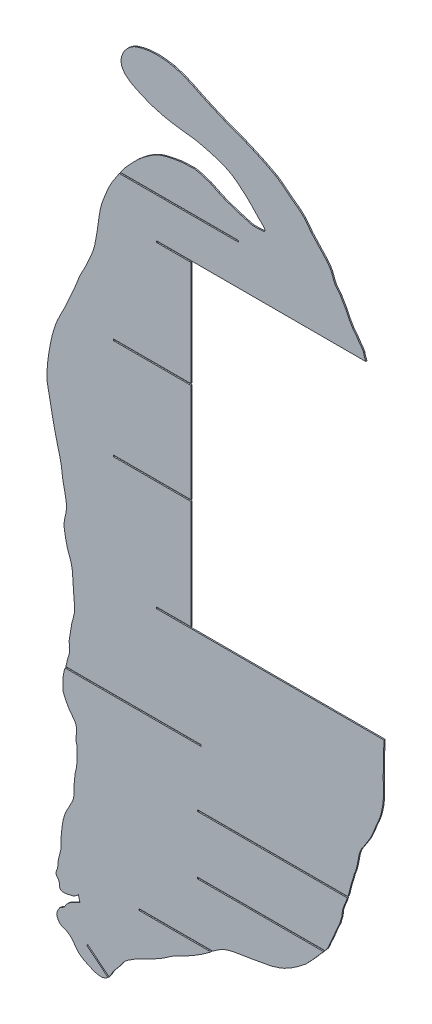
from build123d import *

# Parameters (mm, degrees)
EXTRUDE_1_DEPTH = 2


with BuildPart() as part:
    # Model → Extrude 1 (new body)
    with BuildSketch(Plane.XY):
        Polygon((-5720.7645, 1756.1752), (-5720.7423, 1756.163), (-5719.6567, 1755.4638), (-5719.6284, 1755.4456), (-5711.4029, 1749.8688), (-5701.3941, 1741.8561), (-5694.1958, 1736.0411), (-5685.0639, 1729.304), (-5681.0484, 1726.2993), (-5676.3296, 1721.9313), (-5674.2817, 1720.0016), (-5674.2283, 1719.9514), (-5673.5184, 1719.1248), (-5669.7691, 1714.4466), (-5662.7558, 1705.3026), (-5661.6993, 1703.8581), (-5661.302, 1703.3875), (-5638.8204, 1678.9669), (-5636.7454, 1676.7139), (-5636.463, 1676.3556), (-5636.4556, 1676.3463), (-5631.3712, 1669.6064), (-5631.02, 1668.9962), (-5631.0108, 1668.9803), (-5628.262, 1663.5153), (-5625.3571, 1655.6745), (-5625.1771, 1655.1682), (-5625.1724, 1655.155), (-5622.7109, 1649.7953), (-5621.6774, 1648.0975), (-5619.0281, 1644.9148), (-5618.9591, 1644.8318), (-5615.1097, 1639.7465), (-5613.8187, 1638.0131), (-5613.6729, 1637.7924), (-5613.6691, 1637.7867), (-5605.0998, 1623.1252), (-5599.9363, 1612.4005), (-5599.7194, 1611.9917), (-5599.7137, 1611.981), (-5593.8555, 1601.8342), (-5593.3587, 1600.9935), (-5593.3458, 1600.9716), (-5592.9846, 1600.469), (-5592.9752, 1600.4559), (-5587.3041, 1593.4584), (-5584.6405, 1589.4255), (-5583.3314, 1587.4953), (-5580.1594, 1583.1247), (-5577.6061, 1579.6612), (-5576.2619, 1577.1981), (-5575.3535, 1575.4191), (-5575.3298, 1575.3727), (-5574.8334, 1572.975), (-5574.1541, 1570.9494), (-5572.2273, 1565.5162), (-5571.4104, 1564.1595), (-5919.5427, 1564.1595), (-5919.5427, 1563.9095), (-5919.5427, 1561.9095), (-5919.5427, 1561.6595), (-5862.0015, 1561.6595), (-5862.0015, 1387.1595), (-5990.4768, 1387.1595), (-5990.4768, 1386.9095), (-5990.4768, 1384.9095), (-5990.4768, 1384.6595), (-5862.0015, 1384.6595), (-5862.0016, 1220.1596), (-5990.4768, 1220.1596), (-5990.4768, 1219.9096), (-5990.4768, 1217.9096), (-5990.4768, 1217.6596), (-5862.0016, 1217.6596), (-5862.0016, 1037.3393), (-5919.5428, 1037.3393), (-5919.5428, 1037.0893), (-5919.5428, 1035.0893), (-5919.5428, 1034.8393), (-5541.7403, 1034.8393), (-5541.561, 1030.4145), (-5541.5398, 1029.0932), (-5541.5392, 1029.0588), (-5541.9226, 1021.2011), (-5542.4495, 1012.3566), (-5542.4994, 1011.1336), (-5542.5006, 1011.1017), (-5542.5665, 1002.9496), (-5542.5913, 1002.4057), (-5542.5919, 1002.3915), (-5542.5315, 1000.1406), (-5542.5299, 1000.0819), (-5542.5778, 989.2162), (-5542.7091, 980.2941), (-5542.5697, 970.5373), (-5542.5763, 969.373), (-5542.5764, 969.3427), (-5542.255, 960.2873), (-5542.2417, 959.2189), (-5542.2413, 959.1911), (-5542.2948, 957.2109), (-5542.2962, 957.1593), (-5542.6725, 947.5964), (-5543.3958, 940.8068), (-5543.6448, 938.8814), (-5543.6513, 938.8312), (-5543.8084, 937.9206), (-5543.8124, 937.8969), (-5544.9636, 932.0661), (-5546.9867, 923.516), (-5547.3289, 922.244), (-5547.3378, 922.2109), (-5547.5449, 921.6065), (-5547.5503, 921.5907), (-5547.8286, 920.8103), (-5547.8358, 920.79), (-5551.1221, 912.351), (-5554.4054, 905.2912), (-5554.7184, 904.3753), (-5554.7265, 904.3515), (-5557.6825, 896.8102), (-5557.835, 896.3938), (-5557.8389, 896.383), (-5562.5253, 885.5439), (-5562.765, 885.0756), (-5562.7713, 885.0634), (-5564.5719, 881.4093), (-5564.7081, 881.2076), (-5564.7117, 881.2023), (-5565.2478, 880.4689), (-5565.8129, 879.4608), (-5565.8275, 879.4345), (-5569.2034, 874.1), (-5572.619, 868.7677), (-5576.0961, 863.3578), (-5578.5952, 859.5815), (-5578.6603, 859.4831), (-5579.4531, 858.2458), (-5579.4738, 858.2135), (-5581.3742, 853.3437), (-5582.2903, 850.8766), (-5582.3557, 850.7379), (-5582.3574, 850.7343), (-5583.4484, 845.5478), (-5583.6118, 844.9765), (-5583.6161, 844.9616), (-5584.6919, 838.3944), (-5584.7813, 838.1032), (-5584.7836, 838.0956), (-5584.919, 837.6078), (-5584.9226, 837.5951), (-5584.949, 837.5093), (-5584.9497, 837.507), (-5585.1881, 835.9518), (-5585.1943, 835.9113), (-5586.7528, 829.1264), (-5587.5255, 826.0293), (-5587.5456, 825.9486), (-5588.4413, 823.0538), (-5588.4647, 822.9784), (-5590.8223, 816.9853), (-5592.0294, 812.859), (-5592.2666, 811.5061), (-5592.2728, 811.4709), (-5593.1541, 808.9027), (-5594.577, 804.3442), (-5595.8833, 799.9225), (-5596.6396, 797.2211), (-5599.2746, 786.414), (-5600.2792, 782.6288), (-5600.3054, 782.5302), (-5600.3313, 782.4514), (-5601.2455, 779.6758), (-5850.9317, 779.6758), (-5850.9317, 779.4259), (-5850.9317, 777.4259), (-5850.9317, 777.1758), (-5602.1702, 777.1758), (-5604.2113, 771.6266), (-5605.1583, 769.0752), (-5605.183, 769.0087), (-5606.6002, 765.9443), (-5607.4046, 763.9447), (-5607.7544, 762.9038), (-5607.7635, 762.8766), (-5610.1027, 756.4938), (-5610.5859, 753.0234), (-5610.9729, 750.33), (-5611.0358, 749.0144), (-5611.0374, 748.9801), (-5611.445, 746.7902), (-5611.4667, 745.4723), (-5611.4672, 745.4379), (-5612.1517, 743.0602), (-5612.1695, 742.9982), (-5612.6953, 741.4294), (-5612.7091, 741.3886), (-5613.4852, 738.8095), (-5614.4804, 734.7704), (-5617.9318, 727.475), (-5618.0631, 727.1029), (-5618.0665, 727.0932), (-5618.2178, 726.7603), (-5618.2218, 726.7516), (-5618.3677, 726.5413), (-5618.3715, 726.5358), (-5619.883, 723.3044), (-5622.8162, 716.0453), (-5624.7991, 711.1867), (-5625.8775, 708.6988), (-5625.9056, 708.6339), (-5628.3768, 703.131), (-5630.4803, 698.7765), (-5630.6427, 698.3583), (-5630.647, 698.3473), (-5630.7943, 698.1294), (-5630.7981, 698.1237), (-5633.3043, 691.8984), (-5633.4089, 691.7251), (-5633.4117, 691.7206), (-5633.4667, 691.5334), (-5633.4681, 691.5285), (-5634.5653, 689.2409), (-5635.5597, 687.5232), (-5635.5856, 687.4784), (-5636.2843, 686.5462), (-5636.3025, 686.5219), (-5639.4276, 682.7487), (-5850.9318, 682.7487), (-5850.9318, 682.4987), (-5850.9318, 680.4987), (-5850.9318, 680.2487), (-5641.5986, 680.2487), (-5645.4326, 676.0226), (-5650.2833, 670.6169), (-5652.9255, 667.4826), (-5653.3837, 666.9101), (-5653.3956, 666.8952), (-5653.4103, 666.8893), (-5658.4632, 661.1242), (-5658.8568, 660.7619), (-5658.9264, 660.6786), (-5658.9282, 660.6764), (-5662.8602, 656.4069), (-5663.3469, 655.9148), (-5663.3596, 655.902), (-5669.2565, 649.686), (-5672.9324, 645.8893), (-5673.2878, 645.5675), (-5673.6187, 645.844), (-5673.6273, 645.8512), (-5681.884, 639.2367), (-5683.2779, 638.2514), (-5683.3142, 638.2257), (-5683.6707, 637.9219), (-5683.68, 637.914), (-5691.5084, 632.5395), (-5691.9498, 632.2178), (-5691.9613, 632.2094), (-5692.1858, 632.0243), (-5692.1917, 632.0194), (-5700.4853, 627.0304), (-5701.1116, 626.6805), (-5701.1279, 626.6714), (-5708.062, 623.1426), (-5708.6421, 622.8932), (-5708.6572, 622.8867), (-5713.4533, 620.781), (-5713.876, 620.6418), (-5713.887, 620.6382), (-5719.0112, 619.013), (-5719.1204, 618.9999), (-5719.1232, 618.9995), (-5728.9658, 615.9468), (-5729.1416, 615.9047), (-5729.1461, 615.9036), (-5729.6204, 615.8056), (-5729.6327, 615.803), (-5736.4069, 614.3601), (-5736.9218, 614.5288), (-5736.9352, 614.5332), (-5742.6622, 613.5036), (-5742.8114, 613.4768), (-5758.1019, 610.6018), (-5758.9182, 610.4788), (-5758.9395, 610.4756), (-5759.166, 610.4182), (-5759.1719, 610.4168), (-5769.822, 608.7009), (-5770.6323, 608.5913), (-5770.6535, 608.5884), (-5790.8765, 605.249), (-5792.6693, 604.9299), (-5792.716, 604.9216), (-5801.4142, 602.5936), (-5801.6408, 602.533), (-5802.0875, 602.4373), (-5802.0991, 602.4348), (-5802.2576, 602.3903), (-5802.2617, 602.3892), (-5806.2536, 600.8839), (-5806.3576, 600.8447), (-5806.4725, 600.8019), (-5806.4755, 600.8008), (-5806.5929, 600.747), (-5806.596, 600.7456), (-5812.636, 597.7551), (-5812.7933, 597.6773), (-5812.9477, 597.5992), (-5812.9517, 597.5972), (-5813.1488, 597.4587), (-5813.1539, 597.4551), (-5813.2656, 597.3735), (-5813.2685, 597.3714), (-5820.4168, 592.7578), (-5825.6087, 588.7793), (-5948.6192, 588.7793), (-5948.6192, 588.5293), (-5948.6192, 586.5293), (-5948.6192, 586.2793), (-5828.8713, 586.2793), (-5832.3909, 583.5823), (-5833.4257, 582.8095), (-5833.4526, 582.7893), (-5844.6318, 574.8821), (-5845.0852, 574.5791), (-5845.692, 574.172), (-5845.7078, 574.1614), (-5856.1757, 567.7527), (-5856.8114, 567.377), (-5856.828, 567.3672), (-5857.7402, 566.8385), (-5857.7639, 566.8247), (-5868.8213, 560.5159), (-5883.6381, 553.1712), (-5885.0059, 552.5109), (-5885.0415, 552.4937), (-5885.7383, 552.0853), (-5885.7565, 552.0747), (-5890.7038, 549.4117), (-5890.8327, 549.3423), (-5895.4379, 546.3638), (-5896.0512, 545.9893), (-5896.0671, 545.9795), (-5906.1433, 539.0095), (-5906.8104, 538.5615), (-5906.8278, 538.5498), (-5907.5204, 538.1099), (-5915.1137, 533.5452), (-5916.9269, 532.5501), (-5916.9741, 532.5242), (-5931.263, 524.7666), (-5932.7254, 524.0669), (-5932.7634, 524.0486), (-5948.4082, 516.3801), (-5949.0545, 516.0315), (-5956.3504, 511.9844), (-5957.3703, 511.3503), (-5957.3969, 511.3338), (-5967.6246, 504.7581), (-5971.4758, 501.4592), (-5971.8981, 501.1369), (-5971.9091, 501.1284), (-5972.1318, 500.8996), (-5972.1376, 500.8936), (-5975.1629, 497.6174), (-5975.5079, 497.094), (-5975.5169, 497.0803), (-5980.5388, 489.9724), (-5980.9363, 489.4558), (-5980.9467, 489.4424), (-5988.408, 480.5349), (-5991.2496, 476.7744), (-5991.5918, 476.3649), (-5991.6007, 476.3542), (-5991.7805, 476.0725), (-5991.7852, 476.0651), (-5991.9603, 475.7131), (-5991.9649, 475.7038), (-5992.3936, 474.8481), (-5995.7736, 468.9475), (-5998.0645, 465.7524), (-6033.4784, 494.4301), (-6033.643, 494.2268), (-6033.6459, 494.2291), (-6034.8726, 492.7146), (-6034.8696, 492.7121), (-6035.008, 492.5412), (-5999.7714, 464.0072), (-6003.1079, 461.6398), (-6003.2801, 461.5324), (-6003.2846, 461.5295), (-6003.3905, 461.4885), (-6003.3932, 461.4873), (-6004.248, 461.1423), (-6004.2703, 461.1333), (-6008.0708, 459.6464), (-6008.1698, 459.6076), (-6012.065, 459.3505), (-6012.1665, 459.3437), (-6013.0173, 459.3219), (-6013.0394, 459.3212), (-6016.5416, 459.7731), (-6016.7288, 459.8103), (-6016.7337, 459.8112), (-6020.7661, 460.7807), (-6020.8711, 460.8059), (-6021.0174, 460.8571), (-6021.0213, 460.8584), (-6026.1447, 462.7315), (-6026.2782, 462.7802), (-6027.3551, 463.2395), (-6033.0088, 465.769), (-6038.6387, 468.4306), (-6039.4776, 468.9194), (-6039.4994, 468.9321), (-6040.1791, 469.3569), (-6040.1968, 469.3679), (-6045.2121, 472.3803), (-6045.3428, 472.4587), (-6048.9075, 475.4785), (-6052.3038, 479.3784), (-6052.84, 479.9528), (-6053.0339, 480.1816), (-6053.039, 480.1875), (-6056.8781, 486.0669), (-6057.1957, 486.4362), (-6057.204, 486.4458), (-6059.5072, 489.413), (-6059.5671, 489.4903), (-6063.6073, 493.1882), (-6063.885, 493.4295), (-6063.8922, 493.4358), (-6068.7172, 496.4773), (-6068.9197, 496.5986), (-6068.9249, 496.6018), (-6069.0206, 496.643), (-6069.0231, 496.6441), (-6077.4746, 500.1795), (-6077.6434, 500.2564), (-6080.928, 502.8386), (-6080.9777, 502.8881), (-6080.979, 502.8894), (-6081.007, 502.9244), (-6081.0077, 502.9253), (-6084.408, 509.1157), (-6084.4564, 509.2652), (-6084.4577, 509.2691), (-6085.0195, 512.2205), (-6085.0192, 512.3169), (-6085.0192, 512.3194), (-6085.0056, 512.5235), (-6085.0053, 512.5288), (-6084.2853, 516.0403), (-6083.2029, 519.2211), (-6083.1747, 519.304), (-6083.0755, 519.5486), (-6083.0729, 519.5549), (-6082.2755, 520.8148), (-6082.2548, 520.8477), (-6080.3015, 523.9099), (-6080.1409, 524.1023), (-6079.3021, 524.848), (-6079.2803, 524.8674), (-6078.761, 525.2755), (-6078.7474, 525.2861), (-6075.918, 526.8364), (-6075.8607, 526.8845), (-6073.9029, 528.0642), (-6073.8519, 528.095), (-6071.5021, 530.302), (-6071.4469, 530.3574), (-6071.4454, 530.3589), (-6071.2239, 530.7132), (-6071.2182, 530.7224), (-6069.3932, 533.9463), (-6066.6342, 537.0039), (-6066.4089, 537.2794), (-6066.4031, 537.2866), (-6066.3419, 537.3485), (-6066.3403, 537.3501), (-6063.2214, 539.7859), (-6063.1515, 539.8397), (-6063.1497, 539.8411), (-6060.4361, 541.6019), (-6060.3654, 541.6477), (-6060.2326, 541.7291), (-6060.2291, 541.7312), (-6060.1145, 541.7898), (-6060.1115, 541.7913), (-6055.501, 544.0634), (-6055.3809, 544.1226), (-6055.2175, 544.193), (-6055.2133, 544.1948), (-6046.812, 548.0784), (-6046.5959, 548.1671), (-6046.5902, 548.1695), (-6046.4109, 548.233), (-6046.4063, 548.2346), (-6049.1226, 558.6489), (-6050.7388, 556.8391), (-6050.8156, 556.7154), (-6050.8176, 556.7122), (-6050.9495, 556.6174), (-6050.9529, 556.615), (-6055.692, 553.2566), (-6055.6948, 553.255), (-6055.6976, 553.2537), (-6055.7003, 553.252), (-6055.7032, 553.2506), (-6055.7059, 553.2484), (-6055.7088, 553.2469), (-6055.7116, 553.2457), (-6058.1073, 552.2465), (-6058.1697, 552.2205), (-6058.2439, 552.1924), (-6058.2459, 552.1917), (-6058.4607, 552.1279), (-6058.4663, 552.1262), (-6059.4382, 551.8976), (-6059.4635, 551.8916), (-6067.6043, 550.0833), (-6072.8237, 549.4534), (-6073.2406, 549.4213), (-6073.2515, 549.4204), (-6073.4925, 549.4268), (-6073.4988, 549.427), (-6075.704, 549.6643), (-6075.7615, 549.6704), (-6077.787, 550.3313), (-6078.2321, 550.5269), (-6078.2437, 550.532), (-6079.4532, 551.9439), (-6079.4848, 551.9807), (-6079.5522, 552.078), (-6079.554, 552.0806), (-6079.6691, 552.3499), (-6080.1204, 554.0562), (-6080.6005, 558.5742), (-6080.6742, 559.5191), (-6081.8167, 563.052), (-6081.9385, 563.4658), (-6081.9417, 563.4766), (-6082.406, 564.0519), (-6082.4181, 564.0669), (-6085.3895, 568.2136), (-6086.22, 570.0934), (-6086.2416, 570.1424), (-6086.304, 570.4141), (-6086.3057, 570.4212), (-6086.3072, 570.5413), (-6086.3073, 570.5445), (-6086.2213, 572.3235), (-6086.0617, 572.8491), (-6086.0575, 572.8628), (-6083.4589, 580.0269), (-6083.4269, 580.216), (-6083.426, 580.221), (-6082.8793, 588.4055), (-6082.8569, 588.8184), (-6082.7069, 589.6216), (-6081.2841, 596.6887), (-6078.6132, 607.2295), (-6078.2799, 608.5056), (-6077.653, 613.2378), (-6077.6264, 613.4534), (-6077.6257, 613.459), (-6078.2197, 621.0557), (-6078.2424, 621.4373), (-6078.2429, 621.4473), (-6077.9534, 626.1426), (-6077.9111, 626.5166), (-6077.91, 626.5264), (-6077.1909, 631.5439), (-6076.3452, 641.8529), (-6076.2992, 642.3286), (-6076.298, 642.341), (-6074.4562, 652.9037), (-6074.3689, 653.323), (-6074.3666, 653.3339), (-6074.311, 653.5392), (-6074.3095, 653.5446), (-6072.2733, 660.8131), (-6072.1757, 661.0858), (-6072.1732, 661.0929), (-6069.8623, 667.0331), (-6069.7931, 667.1735), (-6069.7913, 667.1772), (-6069.4073, 667.9236), (-6069.3973, 667.943), (-6059.434, 686.9513), (-6057.9368, 690.727), (-6057.8769, 690.8517), (-6057.8753, 690.8549), (-6057.8444, 691.0012), (-6057.8436, 691.005), (-6056.784, 695.3901), (-6056.3281, 702.7514), (-6056.3021, 702.9563), (-6056.3015, 702.9616), (-6056.3048, 703.0846), (-6056.3049, 703.0878), (-6056.3343, 703.2343), (-6056.5014, 705.9599), (-6056.1418, 713.2592), (-6056.1024, 713.831), (-6055.5219, 718.611), (-6055.5011, 718.7457), (-6055.5006, 718.7492), (-6055.48, 718.9381), (-6055.4794, 718.943), (-6055.4757, 719.0118), (-6055.4757, 719.0136), (-6055.2076, 723.2919), (-6054.4489, 729.5866), (-6054.4413, 729.6994), (-6054.4411, 729.7023), (-6054.4004, 729.9255), (-6054.3994, 729.9313), (-6052.2238, 740.3451), (-6051.768, 743.8149), (-6051.7628, 744.0466), (-6051.7626, 744.0527), (-6051.6499, 750.7292), (-6051.6395, 750.9269), (-6051.6392, 750.932), (-6051.3784, 757.8153), (-6051.3881, 758.0219), (-6051.6134, 763.3871), (-6051.6188, 763.589), (-6051.3325, 770.8131), (-6051.3408, 770.896), (-6051.341, 770.8981), (-6051.3942, 771.1698), (-6052.8486, 777.8656), (-6052.8539, 777.9789), (-6052.8541, 777.9819), (-6052.9916, 782.4408), (-6052.9677, 782.7226), (-6052.0018, 792.6332), (-6052.0062, 793.0568), (-6052.1773, 797.1286), (-6052.4064, 798.0453), (-6053.1232, 800.8664), (-6053.8753, 802.4623), (-6054.5561, 804.3813), (-6056.0642, 806.5041), (-6057.1241, 808.0181), (-6057.1517, 808.0575), (-6061.3537, 813.6928), (-6061.3737, 813.7187), (-6061.3837, 813.7332), (-6064.5982, 818.1261), (-6066.4793, 821.3554), (-6068.2822, 824.5954), (-6068.3745, 824.7843), (-6068.3769, 824.7892), (-6072.4855, 833.3632), (-6074.0581, 837.3744), (-6074.1089, 837.5252), (-6074.1102, 837.5292), (-6074.1564, 837.6806), (-6074.2269, 837.9216), (-6074.2287, 837.9279), (-6074.8837, 842.4086), (-6074.9146, 844.9621), (-6074.8923, 848.4582), (-6074.5061, 858.3456), (-6074.4659, 858.9491), (-6073.2242, 866.2829), (-6071.9416, 871.3627), (-6071.8885, 871.5364), (-6071.8872, 871.5409), (-6071.7281, 872.0756), (-6071.1208, 873.6595), (-5844.9587, 873.6595), (-5844.9587, 873.9096), (-5844.9586, 875.9096), (-5844.9587, 876.1595), (-6070.1623, 876.1595), (-6068.7243, 879.9096), (-6068.6674, 880.222), (-6068.666, 880.2301), (-6067.1885, 888.1906), (-6067.0662, 888.5823), (-6067.0631, 888.5924), (-6064.4558, 896.3527), (-6064.3637, 896.678), (-6064.3613, 896.6864), (-6063.6658, 900.7284), (-6064.2275, 906.6991), (-6064.2348, 906.9756), (-6064.2349, 906.9828), (-6064.0596, 911.0927), (-6064.0593, 911.3119), (-6064.0593, 911.3175), (-6064.0688, 911.4315), (-6064.069, 911.4345), (-6064.0881, 911.4902), (-6064.0886, 911.4916), (-6064.4406, 915.3236), (-6063.7697, 920.4037), (-6063.697, 920.6855), (-6063.6951, 920.6928), (-6063.6855, 920.8986), (-6063.6853, 920.904), (-6062.3162, 928.5595), (-6062.2879, 928.706), (-6062.2872, 928.7099), (-6062.2759, 928.8569), (-6062.2756, 928.8608), (-6062.2695, 929.0163), (-6062.2694, 929.0204), (-6061.6035, 934.0585), (-6060.554, 939.3937), (-6060.4962, 939.6242), (-6060.4947, 939.6303), (-6060.3997, 940.3603), (-6059.9077, 944.1974), (-6058.7263, 948.0905), (-6058.5776, 948.4848), (-6058.5737, 948.495), (-6058.5366, 948.693), (-6058.5356, 948.6982), (-6057.4581, 953.0746), (-6057.4185, 953.1822), (-6057.4174, 953.185), (-6055.9058, 959.5221), (-6055.8762, 959.7936), (-6055.8112, 964.2228), (-6055.7893, 964.3656), (-6055.7888, 964.3693), (-6055.762, 968.1039), (-6055.7366, 968.2807), (-6055.7645, 968.4944), (-6055.7652, 968.4999), (-6055.5516, 971.0815), (-6055.7237, 974.4381), (-6055.7207, 974.668), (-6055.7207, 974.674), (-6055.8813, 976.3315), (-6056.8496, 987.5922), (-6058.5361, 1012.6139), (-6058.7894, 1016.5307), (-6059.4272, 1021.9047), (-6060.3267, 1026.7641), (-6060.3748, 1027.1403), (-6060.4562, 1027.4408), (-6062.3291, 1034.0719), (-6062.6765, 1035.0065), (-6067.1308, 1047.3937), (-6067.3366, 1048.1313), (-6067.342, 1048.1506), (-6068.9282, 1054.5727), (-6070.5589, 1062.3791), (-6070.7465, 1063.381), (-6072.4086, 1072.9579), (-6072.4653, 1073.3772), (-6072.4667, 1073.3881), (-6072.486, 1073.5749), (-6072.4865, 1073.5798), (-6072.8375, 1080.0363), (-6072.8264, 1080.235), (-6072.8261, 1080.2402), (-6072.0959, 1086.5771), (-6072.0029, 1087.0463), (-6069.8565, 1096.778), (-6068.9462, 1103.1401), (-6068.9131, 1103.2942), (-6068.9122, 1103.2983), (-6068.8936, 1103.47), (-6068.8931, 1103.4745), (-6068.8977, 1103.6122), (-6068.8178, 1109.2011), (-6068.8203, 1109.2756), (-6068.8204, 1109.2775), (-6068.8694, 1109.5078), (-6068.8707, 1109.5138), (-6069.2344, 1113.0448), (-6071.5841, 1126.6391), (-6071.679, 1127.2116), (-6071.7677, 1127.6271), (-6073.7811, 1136.8354), (-6073.8302, 1137.0919), (-6073.8315, 1137.0985), (-6075.1843, 1144.5475), (-6075.2739, 1145.2463), (-6077.2106, 1160.5928), (-6077.2889, 1161.0749), (-6079.6213, 1172.6643), (-6079.755, 1173.2218), (-6084.7082, 1192.5008), (-6084.9621, 1193.5003), (-6087.9289, 1205.8529), (-6088.0361, 1206.3051), (-6088.2104, 1207.0732), (-6092.425, 1226.9196), (-6092.5419, 1227.5165), (-6092.7681, 1228.6589), (-6097.1193, 1251.2991), (-6100.3982, 1267.5198), (-6100.5553, 1268.3135), (-6100.573, 1268.4607), (-6100.5734, 1268.4645), (-6101.3593, 1275.8701), (-6101.3656, 1276.1135), (-6101.3658, 1276.1198), (-6101.1283, 1286.5056), (-6101.1068, 1286.8613), (-6101.1062, 1286.8705), (-6099.8982, 1300.1446), (-6099.8604, 1300.4721), (-6099.8594, 1300.4807), (-6099.8305, 1300.7135), (-6099.8298, 1300.7195), (-6098.2028, 1312.6402), (-6098.1186, 1313.1835), (-6098.1164, 1313.1977), (-6096.4264, 1322.914), (-6094.7071, 1332.0339), (-6094.5854, 1332.6161), (-6092.5064, 1341.3824), (-6092.4378, 1341.6553), (-6092.436, 1341.6624), (-6092.3112, 1342.1108), (-6090.1363, 1349.9367), (-6087.0919, 1359.2883), (-6086.9629, 1359.6658), (-6086.9595, 1359.6756), (-6086.8729, 1359.8908), (-6086.8707, 1359.8964), (-6083.4982, 1368.2613), (-6083.3907, 1368.4965), (-6083.3879, 1368.5026), (-6079.7331, 1376.1663), (-6079.5339, 1376.5573), (-6079.5288, 1376.5674), (-6071.2248, 1392.8723), (-6071.0938, 1393.1414), (-6071.0904, 1393.1484), (-6055.0881, 1428.8797), (-6054.8957, 1429.302), (-6054.8907, 1429.313), (-6048.9509, 1444.4758), (-6048.7142, 1445.0622), (-6048.7081, 1445.0775), (-6046.0364, 1451.2798), (-6045.9448, 1451.4821), (-6045.9425, 1451.4874), (-6045.8175, 1451.7554), (-6043.2495, 1456.7717), (-6038.6514, 1465.431), (-6038.3497, 1465.9803), (-6038.2292, 1466.2234), (-6038.226, 1466.2297), (-6035.4104, 1471.9074), (-6035.261, 1472.2509), (-6035.2572, 1472.2598), (-6026.5535, 1492.1559), (-6026.4836, 1492.3267), (-6026.4818, 1492.3311), (-6024.3083, 1497.8181), (-6024.2945, 1497.8575), (-6024.2941, 1497.8586), (-6022.6741, 1503.3915), (-6022.6163, 1503.6229), (-6022.6148, 1503.629), (-6021.2963, 1509.6111), (-6017.8223, 1529.1677), (-6017.6942, 1529.9157), (-6014.6945, 1551.1649), (-6014.5506, 1552.2379), (-6012.6898, 1562.5942), (-6012.5546, 1563.2314), (-6010.2412, 1571.8548), (-6007.7252, 1579.0054), (-6007.6126, 1579.3829), (-6007.6097, 1579.3928), (-6007.5013, 1579.6983), (-6007.4985, 1579.7062), (-6006.8992, 1581.1677), (-6006.8836, 1581.2057), (-6000.0545, 1597.8823), (-5999.3598, 1599.2885), (-5999.3417, 1599.3251), (-5995.8111, 1606.7101), (-5993.5845, 1610.5405), (-5991.9836, 1613.3013), (-5985.0183, 1623.9139), (-5983.3498, 1626.5015), (-5980.9363, 1630.0496), (-5783.4091, 1630.0496), (-5783.4091, 1630.2997), (-5783.4091, 1632.2996), (-5783.4091, 1632.5496), (-5979.2356, 1632.5496), (-5976.8497, 1636.0571), (-5976.442, 1636.6646), (-5976.4313, 1636.6805), (-5975.7322, 1637.5098), (-5971.7402, 1642.6873), (-5966.4016, 1648.7596), (-5965.3872, 1649.8343), (-5957.0622, 1658.6147), (-5956.0016, 1659.6525), (-5955.9739, 1659.6795), (-5950.1926, 1665.5372), (-5943.4578, 1671.1445), (-5939.585, 1674.3679), (-5934.3775, 1678.1569), (-5931.1159, 1680.5043), (-5926.8271, 1683.1942), (-5923.0882, 1685.5257), (-5919.5305, 1687.3697), (-5918.7635, 1687.7949), (-5918.7435, 1687.806), (-5913.1185, 1690.2706), (-5912.7012, 1690.4314), (-5912.6904, 1690.4356), (-5903.9146, 1693.0544), (-5903.256, 1693.2312), (-5903.2388, 1693.2358), (-5891.5202, 1695.8041), (-5890.5953, 1695.9966), (-5890.5712, 1696.0016), (-5889.7828, 1696.1419), (-5889.7623, 1696.1456), (-5880.8346, 1697.6605), (-5879.7448, 1697.7886), (-5879.7164, 1697.7919), (-5872.3587, 1698.4983), (-5872.1671, 1698.5167), (-5871.1394, 1698.5816), (-5862.9037, 1698.7338), (-5857.4505, 1699.1693), (-5856.7573, 1699.0994), (-5856.7393, 1699.0976), (-5849.9513, 1697.9102), (-5849.6025, 1697.801), (-5849.5934, 1697.7982), (-5840.4733, 1695.1245), (-5839.7886, 1694.8735), (-5839.7708, 1694.867), (-5839.1766, 1694.6812), (-5839.1611, 1694.6763), (-5830.2575, 1691.6962), (-5826.5779, 1689.9844), (-5826.482, 1689.9398), (-5825.7088, 1689.6283), (-5825.6887, 1689.6202), (-5822.5504, 1688.0765), (-5815.1532, 1684.5731), (-5812.3564, 1683.4144), (-5805.9614, 1680.3578), (-5805.9583, 1680.3566), (-5805.9552, 1680.3556), (-5805.9521, 1680.3541), (-5805.949, 1680.353), (-5805.9458, 1680.3514), (-5805.9427, 1680.3503), (-5805.9396, 1680.3494), (-5805.908, 1680.3372), (-5805.5894, 1680.2261), (-5805.5811, 1680.2232), (-5783.6768, 1672.6519), (-5781.8538, 1671.9996), (-5781.8063, 1671.9826), (-5779.9533, 1671.5187), (-5774.943, 1670.3895), (-5769.9326, 1668.7858), (-5766.955, 1667.827), (-5766.8774, 1667.8021), (-5766.0323, 1667.665), (-5763.3214, 1666.8438), (-5759.418, 1666.0313), (-5758.7362, 1665.9443), (-5758.7185, 1665.9421), (-5758.3392, 1665.8922), (-5758.3293, 1665.8909), (-5750.7122, 1665.9848), (-5750.0753, 1665.9695), (-5750.0587, 1665.9691), (-5749.2863, 1666.0305), (-5749.2662, 1666.0322), (-5740.8297, 1666.7608), (-5740.6983, 1666.807), (-5740.6949, 1666.8082), (-5740.5835, 1666.8318), (-5740.5806, 1666.8325), (-5740.4958, 1666.9173), (-5738.8343, 1668.2651), (-5739.2095, 1669.4554), (-5739.2072, 1669.5544), (-5739.2072, 1669.5569), (-5739.2854, 1669.686), (-5739.2874, 1669.6894), (-5740.2131, 1671.5744), (-5740.4351, 1671.8198), (-5740.4408, 1671.8262), (-5742.2612, 1674.144), (-5742.87, 1674.7607), (-5742.8859, 1674.7768), (-5750.4371, 1682.3514), (-5759.1585, 1691.6431), (-5759.9774, 1692.5294), (-5759.9987, 1692.5524), (-5769.9729, 1702.4219), (-5770.6423, 1703.065), (-5770.6597, 1703.0817), (-5771.0645, 1703.4396), (-5772.8052, 1704.846), (-5772.8505, 1704.8826), (-5786.6822, 1716.4512), (-5791.4913, 1719.744), (-5794.1331, 1721.6074), (-5796.3314, 1722.7585), (-5804.5966, 1726.9549), (-5804.8916, 1727.0756), (-5804.8992, 1727.0787), (-5816.5935, 1731.626), (-5817.9213, 1732.0578), (-5817.9559, 1732.069), (-5829.1702, 1735.3853), (-5840.3173, 1738.3477), (-5841.7239, 1738.7404), (-5841.7605, 1738.7507), (-5842.163, 1738.8409), (-5842.1735, 1738.8433), (-5850.1091, 1740.6489), (-5850.3882, 1740.6946), (-5850.3955, 1740.6957), (-5857.3704, 1741.8616), (-5857.5521, 1741.892), (-5858.812, 1742.0403), (-5858.8449, 1742.0441), (-5875.7043, 1744.0582), (-5895.1224, 1746.9189), (-5895.7244, 1747.0232), (-5895.7401, 1747.0259), (-5896.2548, 1747.1168), (-5896.2683, 1747.1192), (-5903.0821, 1748.4346), (-5903.2596, 1748.4688), (-5911.4796, 1750.4059), (-5912.9128, 1750.7847), (-5912.9501, 1750.7946), (-5925.2648, 1754.3655), (-5925.8363, 1754.5613), (-5925.8511, 1754.5665), (-5926.3885, 1754.7443), (-5927.5974, 1755.1884), (-5927.6289, 1755.2), (-5936.5014, 1758.4791), (-5936.7325, 1758.5645), (-5941.5938, 1760.4471), (-5946.6258, 1762.7727), (-5946.7569, 1762.8333), (-5951.3374, 1764.9904), (-5951.4567, 1765.0466), (-5958.7006, 1768.5065), (-5959.1691, 1768.7433), (-5959.1813, 1768.7495), (-5959.2944, 1768.8411), (-5959.2973, 1768.8434), (-5959.5227, 1768.9504), (-5959.5285, 1768.9532), (-5963.67, 1771.4391), (-5964.1394, 1771.7576), (-5964.1516, 1771.7659), (-5964.8347, 1772.3499), (-5964.8525, 1772.3651), (-5971.4664, 1777.7413), (-5973.3523, 1780.2893), (-5973.4014, 1780.3557), (-5974.8552, 1782.4014), (-5976.083, 1784.8226), (-5977.0402, 1786.7568), (-5977.0651, 1786.8072), (-5978.0372, 1791.1218), (-5978.1398, 1791.6749), (-5978.1208, 1794.9272), (-5978.1118, 1795.3865), (-5977.457, 1799.3892), (-5975.742, 1804.5285), (-5975.6178, 1804.9638), (-5975.6146, 1804.9752), (-5975.4805, 1805.3304), (-5975.477, 1805.3397), (-5972.7937, 1810.4694), (-5972.6251, 1810.7582), (-5972.6207, 1810.7657), (-5972.254, 1811.1767), (-5966.5415, 1817.5607), (-5966.2806, 1817.782), (-5966.2738, 1817.7878), (-5965.8795, 1818.1387), (-5962.0123, 1821.3027), (-5957.9316, 1823.8708), (-5957.5383, 1824.0894), (-5957.528, 1824.095), (-5957.2098, 1824.2758), (-5957.2015, 1824.2805), (-5956.8424, 1824.4755), (-5956.8331, 1824.4805), (-5953.5332, 1825.9561), (-5953.4472, 1825.9946), (-5950.8427, 1826.9184), (-5950.7749, 1826.9424), (-5946.7997, 1828.0161), (-5946.6961, 1828.044), (-5944.5103, 1828.4951), (-5944.4533, 1828.5069), (-5943.3017, 1829.1634), (-5943.2717, 1829.1805), (-5942.5369, 1829.3428), (-5942.5178, 1829.347), (-5934.1082, 1830.8038), (-5930.7838, 1831.1872), (-5930.6972, 1831.1972), (-5924.3907, 1831.7602), (-5916.7939, 1831.9689), (-5916.082, 1831.9996), (-5916.0634, 1832.0004), (-5909.87, 1831.6291), (-5909.7087, 1831.6194), (-5908.9437, 1831.5653), (-5908.9238, 1831.5639), (-5901.9953, 1830.819), (-5901.0528, 1830.6891), (-5901.0283, 1830.6857), (-5890.4053, 1829.0023), (-5890.1286, 1828.9584), (-5889.9879, 1828.8949), (-5889.9842, 1828.8932), (-5888.8929, 1828.5662), (-5872.8484, 1823.4805), (-5871.6929, 1822.9634), (-5871.6629, 1822.9499), (-5857.6425, 1816.7016), (-5856.8473, 1816.3123), (-5856.8265, 1816.3022), (-5845.9671, 1810.8781), (-5828.9357, 1803.123), (-5828.2228, 1802.7841), (-5828.2042, 1802.7752), (-5826.077, 1801.8576), (-5826.0216, 1801.8337), (-5806.2518, 1793.499), (-5805.3453, 1793.1722), (-5805.3217, 1793.1638), (-5779.0778, 1783.3931), (-5778.6939, 1783.2357), (-5778.6839, 1783.2316), (-5776.4022, 1782.2865), (-5776.3428, 1782.2619), (-5759.2428, 1774.9667), (-5744.8146, 1768.4107), (-5739.9341, 1766.1855), (-5739.807, 1766.1275), (-5725.9043, 1758.8962), (-5721.6198, 1756.643), align=None)
    extrude(amount=EXTRUDE_1_DEPTH)


solid = part.part
